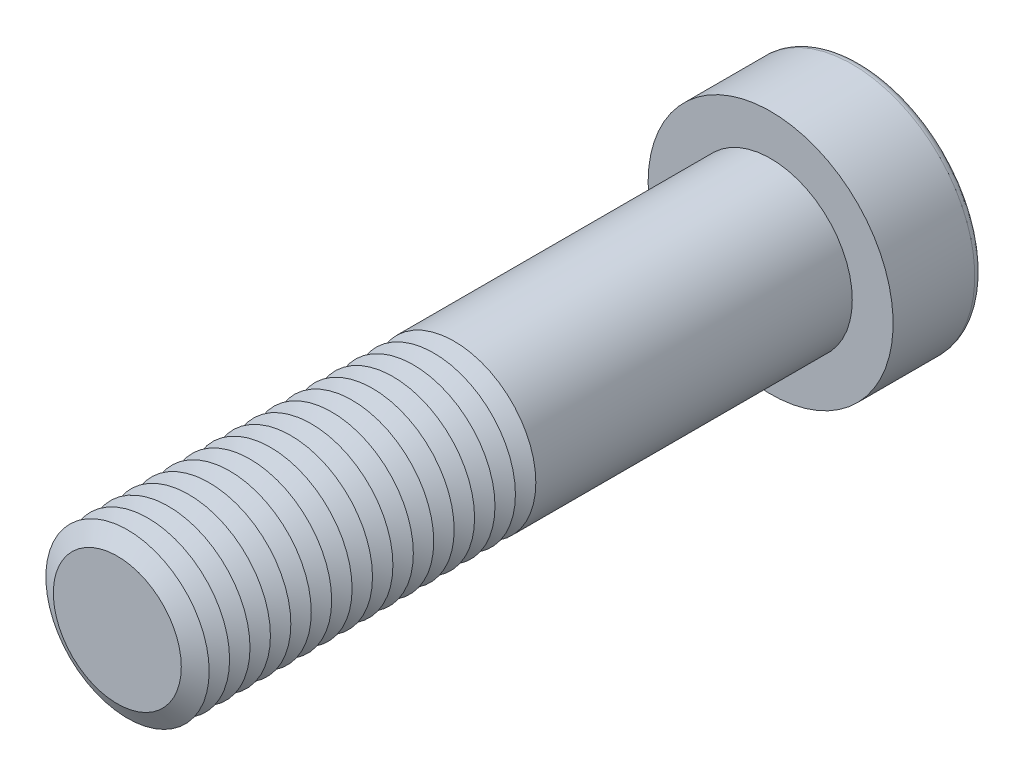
ISO-10303-21;
HEADER;
FILE_DESCRIPTION(('STEP AP214'),'2;1');
FILE_NAME('part.step','',(''),(''),'','','');
FILE_SCHEMA(('AUTOMOTIVE_DESIGN { 1 0 10303 214 1 1 1 1 }'));
ENDSEC;
DATA;
#1=APPLICATION_CONTEXT('core data for automotive mechanical design processes');
#2=APPLICATION_PROTOCOL_DEFINITION('international standard','automotive_design',2000,#1);
#3=PRODUCT_CONTEXT('',#1,'mechanical');
#4=PRODUCT('Part','Part','',(#3));
#5=PRODUCT_RELATED_PRODUCT_CATEGORY('part','',(#4));
#6=PRODUCT_DEFINITION_FORMATION('','',#4);
#7=PRODUCT_DEFINITION_CONTEXT('part definition',#1,'design');
#8=PRODUCT_DEFINITION('design','',#6,#7);
#9=PRODUCT_DEFINITION_SHAPE('','',#8);
#10=(LENGTH_UNIT() NAMED_UNIT(*) SI_UNIT(.MILLI.,.METRE.));
#11=(NAMED_UNIT(*) PLANE_ANGLE_UNIT() SI_UNIT($,.RADIAN.));
#12=(NAMED_UNIT(*) SI_UNIT($,.STERADIAN.) SOLID_ANGLE_UNIT());
#13=UNCERTAINTY_MEASURE_WITH_UNIT(LENGTH_MEASURE(1.E-05),#10,'distance_accuracy_value','');
#14=(GEOMETRIC_REPRESENTATION_CONTEXT(3) GLOBAL_UNCERTAINTY_ASSIGNED_CONTEXT((#13)) GLOBAL_UNIT_ASSIGNED_CONTEXT((#10,
#11,#12)) REPRESENTATION_CONTEXT('',''));
#15=CARTESIAN_POINT('',(0.,0.,0.));
#16=DIRECTION('',(0.,0.,1.));
#17=DIRECTION('',(1.,0.,0.));
#18=AXIS2_PLACEMENT_3D('',#15,#16,#17);
#19=CARTESIAN_POINT('',(0.,0.,71.25));
#20=DIRECTION('',(0.,0.,1.));
#21=DIRECTION('',(1.,0.,0.));
#22=AXIS2_PLACEMENT_3D('',#19,#20,#21);
#23=CONICAL_SURFACE('',#22,10.,1.0471975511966);
#24=CARTESIAN_POINT('',(0.,0.,70.));
#25=DIRECTION('',(0.,0.,1.));
#26=DIRECTION('',(1.,0.,0.));
#27=AXIS2_PLACEMENT_3D('',#24,#25,#26);
#28=CIRCLE('',#27,7.8349364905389);
#29=CARTESIAN_POINT('',(7.8349364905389,0.,70.));
#30=VERTEX_POINT('',#29);
#31=EDGE_CURVE('E313',#30,#30,#28,.T.);
#32=ORIENTED_EDGE('',*,*,#31,.T.);
#33=EDGE_LOOP('',(#32));
#34=FACE_BOUND('',#33,.T.);
#35=CARTESIAN_POINT('',(0.,0.,71.25));
#36=DIRECTION('',(0.,0.,1.));
#37=DIRECTION('',(1.,0.,0.));
#38=AXIS2_PLACEMENT_3D('',#35,#36,#37);
#39=CIRCLE('',#38,10.);
#40=CARTESIAN_POINT('',(10.,0.,71.25));
#41=VERTEX_POINT('',#40);
#42=EDGE_CURVE('E316',#41,#41,#39,.T.);
#43=ORIENTED_EDGE('',*,*,#42,.F.);
#44=EDGE_LOOP('',(#43));
#45=FACE_BOUND('',#44,.T.);
#46=ADVANCED_FACE('F39',(#34,#45),#23,.T.);
#47=CARTESIAN_POINT('',(0.,0.,70.));
#48=DIRECTION('',(0.,0.,-1.));
#49=DIRECTION('',(-1.,0.,0.));
#50=AXIS2_PLACEMENT_3D('',#47,#48,#49);
#51=CONICAL_SURFACE('',#50,7.8349364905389,1.0471975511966);
#52=CARTESIAN_POINT('',(0.,0.,68.75));
#53=DIRECTION('',(0.,0.,1.));
#54=DIRECTION('',(1.,0.,0.));
#55=AXIS2_PLACEMENT_3D('',#52,#53,#54);
#56=CIRCLE('',#55,10.);
#57=CARTESIAN_POINT('',(10.,0.,68.75));
#58=VERTEX_POINT('',#57);
#59=EDGE_CURVE('E324',#58,#58,#56,.T.);
#60=ORIENTED_EDGE('',*,*,#59,.T.);
#61=EDGE_LOOP('',(#60));
#62=FACE_BOUND('',#61,.T.);
#63=ORIENTED_EDGE('',*,*,#31,.F.);
#64=EDGE_LOOP('',(#63));
#65=FACE_BOUND('',#64,.T.);
#66=ADVANCED_FACE('F245',(#62,#65),#51,.T.);
#67=CARTESIAN_POINT('',(0.,0.,80.));
#68=DIRECTION('',(0.,0.,1.));
#69=DIRECTION('',(1.,0.,0.));
#70=AXIS2_PLACEMENT_3D('',#67,#68,#69);
#71=PLANE('',#70);
#72=CARTESIAN_POINT('',(0.,0.,80.));
#73=DIRECTION('',(0.,0.,1.));
#74=DIRECTION('',(1.,0.,0.));
#75=AXIS2_PLACEMENT_3D('',#72,#73,#74);
#76=CIRCLE('',#75,7.8349364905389);
#77=CARTESIAN_POINT('',(7.8349364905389,0.,80.));
#78=VERTEX_POINT('',#77);
#79=EDGE_CURVE('E174',#78,#78,#76,.T.);
#80=ORIENTED_EDGE('',*,*,#79,.T.);
#81=EDGE_LOOP('',(#80));
#82=FACE_BOUND('',#81,.T.);
#83=ADVANCED_FACE('F251',(#82),#71,.T.);
#84=CARTESIAN_POINT('',(0.,0.,80.));
#85=DIRECTION('',(0.,0.,-1.));
#86=DIRECTION('',(-1.,0.,0.));
#87=AXIS2_PLACEMENT_3D('',#84,#85,#86);
#88=CONICAL_SURFACE('',#87,7.8349364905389,1.0471975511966);
#89=CARTESIAN_POINT('',(0.,0.,78.75));
#90=DIRECTION('',(0.,0.,1.));
#91=DIRECTION('',(1.,0.,0.));
#92=AXIS2_PLACEMENT_3D('',#89,#90,#91);
#93=CIRCLE('',#92,10.);
#94=CARTESIAN_POINT('',(10.,0.,78.75));
#95=VERTEX_POINT('',#94);
#96=EDGE_CURVE('E291',#95,#95,#93,.T.);
#97=ORIENTED_EDGE('',*,*,#96,.T.);
#98=EDGE_LOOP('',(#97));
#99=FACE_BOUND('',#98,.T.);
#100=ORIENTED_EDGE('',*,*,#79,.F.);
#101=EDGE_LOOP('',(#100));
#102=FACE_BOUND('',#101,.T.);
#103=ADVANCED_FACE('F199',(#99,#102),#88,.T.);
#104=CARTESIAN_POINT('',(0.,0.,78.75));
#105=DIRECTION('',(0.,0.,1.));
#106=DIRECTION('',(1.,0.,0.));
#107=AXIS2_PLACEMENT_3D('',#104,#105,#106);
#108=CONICAL_SURFACE('',#107,10.,1.0471975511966);
#109=CARTESIAN_POINT('',(0.,0.,77.5));
#110=DIRECTION('',(0.,0.,1.));
#111=DIRECTION('',(1.,0.,0.));
#112=AXIS2_PLACEMENT_3D('',#109,#110,#111);
#113=CIRCLE('',#112,7.8349364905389);
#114=CARTESIAN_POINT('',(7.8349364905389,0.,77.5));
#115=VERTEX_POINT('',#114);
#116=EDGE_CURVE('E288',#115,#115,#113,.T.);
#117=ORIENTED_EDGE('',*,*,#116,.T.);
#118=EDGE_LOOP('',(#117));
#119=FACE_BOUND('',#118,.T.);
#120=ORIENTED_EDGE('',*,*,#96,.F.);
#121=EDGE_LOOP('',(#120));
#122=FACE_BOUND('',#121,.T.);
#123=ADVANCED_FACE('F277',(#119,#122),#108,.T.);
#124=CARTESIAN_POINT('',(0.,0.,77.5));
#125=DIRECTION('',(0.,0.,-1.));
#126=DIRECTION('',(-1.,0.,0.));
#127=AXIS2_PLACEMENT_3D('',#124,#125,#126);
#128=CONICAL_SURFACE('',#127,7.8349364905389,1.0471975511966);
#129=CARTESIAN_POINT('',(0.,0.,76.25));
#130=DIRECTION('',(0.,0.,1.));
#131=DIRECTION('',(1.,0.,0.));
#132=AXIS2_PLACEMENT_3D('',#129,#130,#131);
#133=CIRCLE('',#132,10.);
#134=CARTESIAN_POINT('',(10.,0.,76.25));
#135=VERTEX_POINT('',#134);
#136=EDGE_CURVE('E299',#135,#135,#133,.T.);
#137=ORIENTED_EDGE('',*,*,#136,.T.);
#138=EDGE_LOOP('',(#137));
#139=FACE_BOUND('',#138,.T.);
#140=ORIENTED_EDGE('',*,*,#116,.F.);
#141=EDGE_LOOP('',(#140));
#142=FACE_BOUND('',#141,.T.);
#143=ADVANCED_FACE('F274',(#139,#142),#128,.T.);
#144=CARTESIAN_POINT('',(0.,0.,76.25));
#145=DIRECTION('',(0.,0.,1.));
#146=DIRECTION('',(1.,0.,0.));
#147=AXIS2_PLACEMENT_3D('',#144,#145,#146);
#148=CONICAL_SURFACE('',#147,10.,1.0471975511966);
#149=CARTESIAN_POINT('',(0.,0.,75.));
#150=DIRECTION('',(0.,0.,1.));
#151=DIRECTION('',(1.,0.,0.));
#152=AXIS2_PLACEMENT_3D('',#149,#150,#151);
#153=CIRCLE('',#152,7.8349364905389);
#154=CARTESIAN_POINT('',(7.8349364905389,0.,75.));
#155=VERTEX_POINT('',#154);
#156=EDGE_CURVE('E293',#155,#155,#153,.T.);
#157=ORIENTED_EDGE('',*,*,#156,.T.);
#158=EDGE_LOOP('',(#157));
#159=FACE_BOUND('',#158,.T.);
#160=ORIENTED_EDGE('',*,*,#136,.F.);
#161=EDGE_LOOP('',(#160));
#162=FACE_BOUND('',#161,.T.);
#163=ADVANCED_FACE('F270',(#159,#162),#148,.T.);
#164=CARTESIAN_POINT('',(0.,0.,75.));
#165=DIRECTION('',(0.,0.,-1.));
#166=DIRECTION('',(-1.,0.,0.));
#167=AXIS2_PLACEMENT_3D('',#164,#165,#166);
#168=CONICAL_SURFACE('',#167,7.8349364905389,1.0471975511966);
#169=CARTESIAN_POINT('',(0.,0.,73.75));
#170=DIRECTION('',(0.,0.,1.));
#171=DIRECTION('',(1.,0.,0.));
#172=AXIS2_PLACEMENT_3D('',#169,#170,#171);
#173=CIRCLE('',#172,10.);
#174=CARTESIAN_POINT('',(10.,0.,73.75));
#175=VERTEX_POINT('',#174);
#176=EDGE_CURVE('E309',#175,#175,#173,.T.);
#177=ORIENTED_EDGE('',*,*,#176,.T.);
#178=EDGE_LOOP('',(#177));
#179=FACE_BOUND('',#178,.T.);
#180=ORIENTED_EDGE('',*,*,#156,.F.);
#181=EDGE_LOOP('',(#180));
#182=FACE_BOUND('',#181,.T.);
#183=ADVANCED_FACE('F266',(#179,#182),#168,.T.);
#184=CARTESIAN_POINT('',(0.,0.,73.75));
#185=DIRECTION('',(0.,0.,1.));
#186=DIRECTION('',(1.,0.,0.));
#187=AXIS2_PLACEMENT_3D('',#184,#185,#186);
#188=CONICAL_SURFACE('',#187,10.,1.0471975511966);
#189=CARTESIAN_POINT('',(0.,0.,72.5));
#190=DIRECTION('',(0.,0.,1.));
#191=DIRECTION('',(1.,0.,0.));
#192=AXIS2_PLACEMENT_3D('',#189,#190,#191);
#193=CIRCLE('',#192,7.8349364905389);
#194=CARTESIAN_POINT('',(7.8349364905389,0.,72.5));
#195=VERTEX_POINT('',#194);
#196=EDGE_CURVE('E305',#195,#195,#193,.T.);
#197=ORIENTED_EDGE('',*,*,#196,.T.);
#198=EDGE_LOOP('',(#197));
#199=FACE_BOUND('',#198,.T.);
#200=ORIENTED_EDGE('',*,*,#176,.F.);
#201=EDGE_LOOP('',(#200));
#202=FACE_BOUND('',#201,.T.);
#203=ADVANCED_FACE('F262',(#199,#202),#188,.T.);
#204=CARTESIAN_POINT('',(0.,0.,72.5));
#205=DIRECTION('',(0.,0.,-1.));
#206=DIRECTION('',(-1.,0.,0.));
#207=AXIS2_PLACEMENT_3D('',#204,#205,#206);
#208=CONICAL_SURFACE('',#207,7.8349364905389,1.0471975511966);
#209=ORIENTED_EDGE('',*,*,#42,.T.);
#210=EDGE_LOOP('',(#209));
#211=FACE_BOUND('',#210,.T.);
#212=ORIENTED_EDGE('',*,*,#196,.F.);
#213=EDGE_LOOP('',(#212));
#214=FACE_BOUND('',#213,.T.);
#215=ADVANCED_FACE('F258',(#211,#214),#208,.T.);
#216=CARTESIAN_POINT('',(0.,0.,68.75));
#217=DIRECTION('',(0.,0.,1.));
#218=DIRECTION('',(1.,0.,0.));
#219=AXIS2_PLACEMENT_3D('',#216,#217,#218);
#220=CONICAL_SURFACE('',#219,10.,1.0471975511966);
#221=CARTESIAN_POINT('',(0.,0.,67.5));
#222=DIRECTION('',(0.,0.,1.));
#223=DIRECTION('',(1.,0.,0.));
#224=AXIS2_PLACEMENT_3D('',#221,#222,#223);
#225=CIRCLE('',#224,7.8349364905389);
#226=CARTESIAN_POINT('',(7.8349364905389,0.,67.5));
#227=VERTEX_POINT('',#226);
#228=EDGE_CURVE('E320',#227,#227,#225,.T.);
#229=ORIENTED_EDGE('',*,*,#228,.T.);
#230=EDGE_LOOP('',(#229));
#231=FACE_BOUND('',#230,.T.);
#232=ORIENTED_EDGE('',*,*,#59,.F.);
#233=EDGE_LOOP('',(#232));
#234=FACE_BOUND('',#233,.T.);
#235=ADVANCED_FACE('F261',(#231,#234),#220,.T.);
#236=CARTESIAN_POINT('',(0.,0.,67.5));
#237=DIRECTION('',(0.,0.,-1.));
#238=DIRECTION('',(-1.,0.,0.));
#239=AXIS2_PLACEMENT_3D('',#236,#237,#238);
#240=CONICAL_SURFACE('',#239,7.8349364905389,1.0471975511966);
#241=CARTESIAN_POINT('',(0.,0.,66.25));
#242=DIRECTION('',(0.,0.,1.));
#243=DIRECTION('',(1.,0.,0.));
#244=AXIS2_PLACEMENT_3D('',#241,#242,#243);
#245=CIRCLE('',#244,10.);
#246=CARTESIAN_POINT('',(10.,0.,66.25));
#247=VERTEX_POINT('',#246);
#248=EDGE_CURVE('E331',#247,#247,#245,.T.);
#249=ORIENTED_EDGE('',*,*,#248,.T.);
#250=EDGE_LOOP('',(#249));
#251=FACE_BOUND('',#250,.T.);
#252=ORIENTED_EDGE('',*,*,#228,.F.);
#253=EDGE_LOOP('',(#252));
#254=FACE_BOUND('',#253,.T.);
#255=ADVANCED_FACE('F511',(#251,#254),#240,.T.);
#256=CARTESIAN_POINT('',(0.,0.,66.25));
#257=DIRECTION('',(0.,0.,1.));
#258=DIRECTION('',(1.,0.,0.));
#259=AXIS2_PLACEMENT_3D('',#256,#257,#258);
#260=CONICAL_SURFACE('',#259,10.,1.0471975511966);
#261=CARTESIAN_POINT('',(0.,0.,65.));
#262=DIRECTION('',(0.,0.,1.));
#263=DIRECTION('',(1.,0.,0.));
#264=AXIS2_PLACEMENT_3D('',#261,#262,#263);
#265=CIRCLE('',#264,7.8349364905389);
#266=CARTESIAN_POINT('',(7.8349364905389,0.,65.));
#267=VERTEX_POINT('',#266);
#268=EDGE_CURVE('E327',#267,#267,#265,.T.);
#269=ORIENTED_EDGE('',*,*,#268,.T.);
#270=EDGE_LOOP('',(#269));
#271=FACE_BOUND('',#270,.T.);
#272=ORIENTED_EDGE('',*,*,#248,.F.);
#273=EDGE_LOOP('',(#272));
#274=FACE_BOUND('',#273,.T.);
#275=ADVANCED_FACE('F507',(#271,#274),#260,.T.);
#276=CARTESIAN_POINT('',(0.,0.,65.));
#277=DIRECTION('',(0.,0.,-1.));
#278=DIRECTION('',(-1.,0.,0.));
#279=AXIS2_PLACEMENT_3D('',#276,#277,#278);
#280=CONICAL_SURFACE('',#279,7.8349364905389,1.0471975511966);
#281=CARTESIAN_POINT('',(0.,0.,63.75));
#282=DIRECTION('',(0.,0.,1.));
#283=DIRECTION('',(1.,0.,0.));
#284=AXIS2_PLACEMENT_3D('',#281,#282,#283);
#285=CIRCLE('',#284,10.);
#286=CARTESIAN_POINT('',(10.,0.,63.75));
#287=VERTEX_POINT('',#286);
#288=EDGE_CURVE('E339',#287,#287,#285,.T.);
#289=ORIENTED_EDGE('',*,*,#288,.T.);
#290=EDGE_LOOP('',(#289));
#291=FACE_BOUND('',#290,.T.);
#292=ORIENTED_EDGE('',*,*,#268,.F.);
#293=EDGE_LOOP('',(#292));
#294=FACE_BOUND('',#293,.T.);
#295=ADVANCED_FACE('F503',(#291,#294),#280,.T.);
#296=CARTESIAN_POINT('',(0.,0.,63.75));
#297=DIRECTION('',(0.,0.,1.));
#298=DIRECTION('',(1.,0.,0.));
#299=AXIS2_PLACEMENT_3D('',#296,#297,#298);
#300=CONICAL_SURFACE('',#299,10.,1.0471975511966);
#301=CARTESIAN_POINT('',(0.,0.,62.5));
#302=DIRECTION('',(0.,0.,1.));
#303=DIRECTION('',(1.,0.,0.));
#304=AXIS2_PLACEMENT_3D('',#301,#302,#303);
#305=CIRCLE('',#304,7.8349364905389);
#306=CARTESIAN_POINT('',(7.8349364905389,0.,62.5));
#307=VERTEX_POINT('',#306);
#308=EDGE_CURVE('E335',#307,#307,#305,.T.);
#309=ORIENTED_EDGE('',*,*,#308,.T.);
#310=EDGE_LOOP('',(#309));
#311=FACE_BOUND('',#310,.T.);
#312=ORIENTED_EDGE('',*,*,#288,.F.);
#313=EDGE_LOOP('',(#312));
#314=FACE_BOUND('',#313,.T.);
#315=ADVANCED_FACE('F499',(#311,#314),#300,.T.);
#316=CARTESIAN_POINT('',(0.,0.,62.5));
#317=DIRECTION('',(0.,0.,-1.));
#318=DIRECTION('',(-1.,0.,0.));
#319=AXIS2_PLACEMENT_3D('',#316,#317,#318);
#320=CONICAL_SURFACE('',#319,7.8349364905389,1.0471975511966);
#321=CARTESIAN_POINT('',(0.,0.,61.25));
#322=DIRECTION('',(0.,0.,1.));
#323=DIRECTION('',(1.,0.,0.));
#324=AXIS2_PLACEMENT_3D('',#321,#322,#323);
#325=CIRCLE('',#324,10.);
#326=CARTESIAN_POINT('',(10.,0.,61.25));
#327=VERTEX_POINT('',#326);
#328=EDGE_CURVE('E347',#327,#327,#325,.T.);
#329=ORIENTED_EDGE('',*,*,#328,.T.);
#330=EDGE_LOOP('',(#329));
#331=FACE_BOUND('',#330,.T.);
#332=ORIENTED_EDGE('',*,*,#308,.F.);
#333=EDGE_LOOP('',(#332));
#334=FACE_BOUND('',#333,.T.);
#335=ADVANCED_FACE('F495',(#331,#334),#320,.T.);
#336=CARTESIAN_POINT('',(0.,0.,61.25));
#337=DIRECTION('',(0.,0.,1.));
#338=DIRECTION('',(1.,0.,0.));
#339=AXIS2_PLACEMENT_3D('',#336,#337,#338);
#340=CONICAL_SURFACE('',#339,10.,1.0471975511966);
#341=CARTESIAN_POINT('',(0.,0.,60.));
#342=DIRECTION('',(0.,0.,1.));
#343=DIRECTION('',(1.,0.,0.));
#344=AXIS2_PLACEMENT_3D('',#341,#342,#343);
#345=CIRCLE('',#344,7.8349364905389);
#346=CARTESIAN_POINT('',(7.8349364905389,0.,60.));
#347=VERTEX_POINT('',#346);
#348=EDGE_CURVE('E343',#347,#347,#345,.T.);
#349=ORIENTED_EDGE('',*,*,#348,.T.);
#350=EDGE_LOOP('',(#349));
#351=FACE_BOUND('',#350,.T.);
#352=ORIENTED_EDGE('',*,*,#328,.F.);
#353=EDGE_LOOP('',(#352));
#354=FACE_BOUND('',#353,.T.);
#355=ADVANCED_FACE('F491',(#351,#354),#340,.T.);
#356=CARTESIAN_POINT('',(0.,0.,60.));
#357=DIRECTION('',(0.,0.,-1.));
#358=DIRECTION('',(-1.,0.,0.));
#359=AXIS2_PLACEMENT_3D('',#356,#357,#358);
#360=CONICAL_SURFACE('',#359,7.8349364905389,1.0471975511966);
#361=CARTESIAN_POINT('',(0.,0.,58.75));
#362=DIRECTION('',(0.,0.,1.));
#363=DIRECTION('',(1.,0.,0.));
#364=AXIS2_PLACEMENT_3D('',#361,#362,#363);
#365=CIRCLE('',#364,10.);
#366=CARTESIAN_POINT('',(10.,0.,58.75));
#367=VERTEX_POINT('',#366);
#368=EDGE_CURVE('E355',#367,#367,#365,.T.);
#369=ORIENTED_EDGE('',*,*,#368,.T.);
#370=EDGE_LOOP('',(#369));
#371=FACE_BOUND('',#370,.T.);
#372=ORIENTED_EDGE('',*,*,#348,.F.);
#373=EDGE_LOOP('',(#372));
#374=FACE_BOUND('',#373,.T.);
#375=ADVANCED_FACE('F487',(#371,#374),#360,.T.);
#376=CARTESIAN_POINT('',(0.,0.,58.75));
#377=DIRECTION('',(0.,0.,1.));
#378=DIRECTION('',(1.,0.,0.));
#379=AXIS2_PLACEMENT_3D('',#376,#377,#378);
#380=CONICAL_SURFACE('',#379,10.,1.0471975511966);
#381=CARTESIAN_POINT('',(0.,0.,57.5));
#382=DIRECTION('',(0.,0.,1.));
#383=DIRECTION('',(1.,0.,0.));
#384=AXIS2_PLACEMENT_3D('',#381,#382,#383);
#385=CIRCLE('',#384,7.8349364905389);
#386=CARTESIAN_POINT('',(7.8349364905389,0.,57.5));
#387=VERTEX_POINT('',#386);
#388=EDGE_CURVE('E351',#387,#387,#385,.T.);
#389=ORIENTED_EDGE('',*,*,#388,.T.);
#390=EDGE_LOOP('',(#389));
#391=FACE_BOUND('',#390,.T.);
#392=ORIENTED_EDGE('',*,*,#368,.F.);
#393=EDGE_LOOP('',(#392));
#394=FACE_BOUND('',#393,.T.);
#395=ADVANCED_FACE('F483',(#391,#394),#380,.T.);
#396=CARTESIAN_POINT('',(0.,0.,57.5));
#397=DIRECTION('',(0.,0.,-1.));
#398=DIRECTION('',(-1.,0.,0.));
#399=AXIS2_PLACEMENT_3D('',#396,#397,#398);
#400=CONICAL_SURFACE('',#399,7.8349364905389,1.0471975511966);
#401=CARTESIAN_POINT('',(0.,0.,56.25));
#402=DIRECTION('',(0.,0.,1.));
#403=DIRECTION('',(1.,0.,0.));
#404=AXIS2_PLACEMENT_3D('',#401,#402,#403);
#405=CIRCLE('',#404,10.);
#406=CARTESIAN_POINT('',(10.,0.,56.25));
#407=VERTEX_POINT('',#406);
#408=EDGE_CURVE('E363',#407,#407,#405,.T.);
#409=ORIENTED_EDGE('',*,*,#408,.T.);
#410=EDGE_LOOP('',(#409));
#411=FACE_BOUND('',#410,.T.);
#412=ORIENTED_EDGE('',*,*,#388,.F.);
#413=EDGE_LOOP('',(#412));
#414=FACE_BOUND('',#413,.T.);
#415=ADVANCED_FACE('F479',(#411,#414),#400,.T.);
#416=CARTESIAN_POINT('',(0.,0.,56.25));
#417=DIRECTION('',(0.,0.,1.));
#418=DIRECTION('',(1.,0.,0.));
#419=AXIS2_PLACEMENT_3D('',#416,#417,#418);
#420=CONICAL_SURFACE('',#419,10.,1.0471975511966);
#421=CARTESIAN_POINT('',(0.,0.,55.));
#422=DIRECTION('',(0.,0.,1.));
#423=DIRECTION('',(1.,0.,0.));
#424=AXIS2_PLACEMENT_3D('',#421,#422,#423);
#425=CIRCLE('',#424,7.8349364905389);
#426=CARTESIAN_POINT('',(7.8349364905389,0.,55.));
#427=VERTEX_POINT('',#426);
#428=EDGE_CURVE('E359',#427,#427,#425,.T.);
#429=ORIENTED_EDGE('',*,*,#428,.T.);
#430=EDGE_LOOP('',(#429));
#431=FACE_BOUND('',#430,.T.);
#432=ORIENTED_EDGE('',*,*,#408,.F.);
#433=EDGE_LOOP('',(#432));
#434=FACE_BOUND('',#433,.T.);
#435=ADVANCED_FACE('F475',(#431,#434),#420,.T.);
#436=CARTESIAN_POINT('',(0.,0.,55.));
#437=DIRECTION('',(0.,0.,-1.));
#438=DIRECTION('',(-1.,0.,0.));
#439=AXIS2_PLACEMENT_3D('',#436,#437,#438);
#440=CONICAL_SURFACE('',#439,7.8349364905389,1.0471975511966);
#441=CARTESIAN_POINT('',(0.,0.,53.75));
#442=DIRECTION('',(0.,0.,1.));
#443=DIRECTION('',(1.,0.,0.));
#444=AXIS2_PLACEMENT_3D('',#441,#442,#443);
#445=CIRCLE('',#444,10.);
#446=CARTESIAN_POINT('',(10.,0.,53.75));
#447=VERTEX_POINT('',#446);
#448=EDGE_CURVE('E371',#447,#447,#445,.T.);
#449=ORIENTED_EDGE('',*,*,#448,.T.);
#450=EDGE_LOOP('',(#449));
#451=FACE_BOUND('',#450,.T.);
#452=ORIENTED_EDGE('',*,*,#428,.F.);
#453=EDGE_LOOP('',(#452));
#454=FACE_BOUND('',#453,.T.);
#455=ADVANCED_FACE('F471',(#451,#454),#440,.T.);
#456=CARTESIAN_POINT('',(0.,0.,53.75));
#457=DIRECTION('',(0.,0.,1.));
#458=DIRECTION('',(1.,0.,0.));
#459=AXIS2_PLACEMENT_3D('',#456,#457,#458);
#460=CONICAL_SURFACE('',#459,10.,1.0471975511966);
#461=CARTESIAN_POINT('',(0.,0.,52.5));
#462=DIRECTION('',(0.,0.,1.));
#463=DIRECTION('',(1.,0.,0.));
#464=AXIS2_PLACEMENT_3D('',#461,#462,#463);
#465=CIRCLE('',#464,7.8349364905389);
#466=CARTESIAN_POINT('',(7.8349364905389,0.,52.5));
#467=VERTEX_POINT('',#466);
#468=EDGE_CURVE('E367',#467,#467,#465,.T.);
#469=ORIENTED_EDGE('',*,*,#468,.T.);
#470=EDGE_LOOP('',(#469));
#471=FACE_BOUND('',#470,.T.);
#472=ORIENTED_EDGE('',*,*,#448,.F.);
#473=EDGE_LOOP('',(#472));
#474=FACE_BOUND('',#473,.T.);
#475=ADVANCED_FACE('F467',(#471,#474),#460,.T.);
#476=CARTESIAN_POINT('',(0.,0.,52.5));
#477=DIRECTION('',(0.,0.,-1.));
#478=DIRECTION('',(-1.,0.,0.));
#479=AXIS2_PLACEMENT_3D('',#476,#477,#478);
#480=CONICAL_SURFACE('',#479,7.8349364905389,1.0471975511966);
#481=CARTESIAN_POINT('',(0.,0.,51.25));
#482=DIRECTION('',(0.,0.,1.));
#483=DIRECTION('',(1.,0.,0.));
#484=AXIS2_PLACEMENT_3D('',#481,#482,#483);
#485=CIRCLE('',#484,10.);
#486=CARTESIAN_POINT('',(10.,0.,51.25));
#487=VERTEX_POINT('',#486);
#488=EDGE_CURVE('E379',#487,#487,#485,.T.);
#489=ORIENTED_EDGE('',*,*,#488,.T.);
#490=EDGE_LOOP('',(#489));
#491=FACE_BOUND('',#490,.T.);
#492=ORIENTED_EDGE('',*,*,#468,.F.);
#493=EDGE_LOOP('',(#492));
#494=FACE_BOUND('',#493,.T.);
#495=ADVANCED_FACE('F463',(#491,#494),#480,.T.);
#496=CARTESIAN_POINT('',(0.,0.,51.25));
#497=DIRECTION('',(0.,0.,1.));
#498=DIRECTION('',(1.,0.,0.));
#499=AXIS2_PLACEMENT_3D('',#496,#497,#498);
#500=CONICAL_SURFACE('',#499,10.,1.0471975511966);
#501=CARTESIAN_POINT('',(0.,0.,50.));
#502=DIRECTION('',(0.,0.,1.));
#503=DIRECTION('',(1.,0.,0.));
#504=AXIS2_PLACEMENT_3D('',#501,#502,#503);
#505=CIRCLE('',#504,7.8349364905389);
#506=CARTESIAN_POINT('',(7.8349364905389,0.,50.));
#507=VERTEX_POINT('',#506);
#508=EDGE_CURVE('E375',#507,#507,#505,.T.);
#509=ORIENTED_EDGE('',*,*,#508,.T.);
#510=EDGE_LOOP('',(#509));
#511=FACE_BOUND('',#510,.T.);
#512=ORIENTED_EDGE('',*,*,#488,.F.);
#513=EDGE_LOOP('',(#512));
#514=FACE_BOUND('',#513,.T.);
#515=ADVANCED_FACE('F459',(#511,#514),#500,.T.);
#516=CARTESIAN_POINT('',(0.,0.,50.));
#517=DIRECTION('',(0.,0.,-1.));
#518=DIRECTION('',(-1.,0.,0.));
#519=AXIS2_PLACEMENT_3D('',#516,#517,#518);
#520=CONICAL_SURFACE('',#519,7.8349364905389,1.0471975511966);
#521=CARTESIAN_POINT('',(0.,0.,48.75));
#522=DIRECTION('',(0.,0.,1.));
#523=DIRECTION('',(1.,0.,0.));
#524=AXIS2_PLACEMENT_3D('',#521,#522,#523);
#525=CIRCLE('',#524,10.);
#526=CARTESIAN_POINT('',(10.,0.,48.75));
#527=VERTEX_POINT('',#526);
#528=EDGE_CURVE('E386',#527,#527,#525,.T.);
#529=ORIENTED_EDGE('',*,*,#528,.T.);
#530=EDGE_LOOP('',(#529));
#531=FACE_BOUND('',#530,.T.);
#532=ORIENTED_EDGE('',*,*,#508,.F.);
#533=EDGE_LOOP('',(#532));
#534=FACE_BOUND('',#533,.T.);
#535=ADVANCED_FACE('F455',(#531,#534),#520,.T.);
#536=CARTESIAN_POINT('',(0.,0.,48.75));
#537=DIRECTION('',(0.,0.,1.));
#538=DIRECTION('',(1.,0.,0.));
#539=AXIS2_PLACEMENT_3D('',#536,#537,#538);
#540=CONICAL_SURFACE('',#539,10.,1.0471975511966);
#541=CARTESIAN_POINT('',(0.,0.,47.5));
#542=DIRECTION('',(0.,0.,1.));
#543=DIRECTION('',(1.,0.,0.));
#544=AXIS2_PLACEMENT_3D('',#541,#542,#543);
#545=CIRCLE('',#544,7.8349364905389);
#546=CARTESIAN_POINT('',(7.8349364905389,0.,47.5));
#547=VERTEX_POINT('',#546);
#548=EDGE_CURVE('E382',#547,#547,#545,.T.);
#549=ORIENTED_EDGE('',*,*,#548,.T.);
#550=EDGE_LOOP('',(#549));
#551=FACE_BOUND('',#550,.T.);
#552=ORIENTED_EDGE('',*,*,#528,.F.);
#553=EDGE_LOOP('',(#552));
#554=FACE_BOUND('',#553,.T.);
#555=ADVANCED_FACE('F451',(#551,#554),#540,.T.);
#556=CARTESIAN_POINT('',(0.,0.,47.5));
#557=DIRECTION('',(0.,0.,-1.));
#558=DIRECTION('',(-1.,0.,0.));
#559=AXIS2_PLACEMENT_3D('',#556,#557,#558);
#560=CONICAL_SURFACE('',#559,7.8349364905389,1.0471975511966);
#561=CARTESIAN_POINT('',(0.,0.,46.25));
#562=DIRECTION('',(0.,0.,1.));
#563=DIRECTION('',(1.,0.,0.));
#564=AXIS2_PLACEMENT_3D('',#561,#562,#563);
#565=CIRCLE('',#564,10.);
#566=CARTESIAN_POINT('',(10.,0.,46.25));
#567=VERTEX_POINT('',#566);
#568=EDGE_CURVE('E394',#567,#567,#565,.T.);
#569=ORIENTED_EDGE('',*,*,#568,.T.);
#570=EDGE_LOOP('',(#569));
#571=FACE_BOUND('',#570,.T.);
#572=ORIENTED_EDGE('',*,*,#548,.F.);
#573=EDGE_LOOP('',(#572));
#574=FACE_BOUND('',#573,.T.);
#575=ADVANCED_FACE('F447',(#571,#574),#560,.T.);
#576=CARTESIAN_POINT('',(0.,0.,46.25));
#577=DIRECTION('',(0.,0.,1.));
#578=DIRECTION('',(1.,0.,0.));
#579=AXIS2_PLACEMENT_3D('',#576,#577,#578);
#580=CONICAL_SURFACE('',#579,10.,1.0471975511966);
#581=CARTESIAN_POINT('',(0.,0.,45.));
#582=DIRECTION('',(0.,0.,1.));
#583=DIRECTION('',(1.,0.,0.));
#584=AXIS2_PLACEMENT_3D('',#581,#582,#583);
#585=CIRCLE('',#584,7.8349364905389);
#586=CARTESIAN_POINT('',(7.8349364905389,0.,45.));
#587=VERTEX_POINT('',#586);
#588=EDGE_CURVE('E390',#587,#587,#585,.T.);
#589=ORIENTED_EDGE('',*,*,#588,.T.);
#590=EDGE_LOOP('',(#589));
#591=FACE_BOUND('',#590,.T.);
#592=ORIENTED_EDGE('',*,*,#568,.F.);
#593=EDGE_LOOP('',(#592));
#594=FACE_BOUND('',#593,.T.);
#595=ADVANCED_FACE('F443',(#591,#594),#580,.T.);
#596=CARTESIAN_POINT('',(0.,0.,45.));
#597=DIRECTION('',(0.,0.,-1.));
#598=DIRECTION('',(-1.,0.,0.));
#599=AXIS2_PLACEMENT_3D('',#596,#597,#598);
#600=CONICAL_SURFACE('',#599,7.8349364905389,1.0471975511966);
#601=CARTESIAN_POINT('',(0.,0.,43.75));
#602=DIRECTION('',(0.,0.,1.));
#603=DIRECTION('',(1.,0.,0.));
#604=AXIS2_PLACEMENT_3D('',#601,#602,#603);
#605=CIRCLE('',#604,10.);
#606=CARTESIAN_POINT('',(10.,0.,43.75));
#607=VERTEX_POINT('',#606);
#608=EDGE_CURVE('E402',#607,#607,#605,.T.);
#609=ORIENTED_EDGE('',*,*,#608,.T.);
#610=EDGE_LOOP('',(#609));
#611=FACE_BOUND('',#610,.T.);
#612=ORIENTED_EDGE('',*,*,#588,.F.);
#613=EDGE_LOOP('',(#612));
#614=FACE_BOUND('',#613,.T.);
#615=ADVANCED_FACE('F439',(#611,#614),#600,.T.);
#616=CARTESIAN_POINT('',(0.,0.,43.75));
#617=DIRECTION('',(0.,0.,1.));
#618=DIRECTION('',(1.,0.,0.));
#619=AXIS2_PLACEMENT_3D('',#616,#617,#618);
#620=CONICAL_SURFACE('',#619,10.,1.0471975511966);
#621=CARTESIAN_POINT('',(0.,0.,42.5));
#622=DIRECTION('',(0.,0.,1.));
#623=DIRECTION('',(1.,0.,0.));
#624=AXIS2_PLACEMENT_3D('',#621,#622,#623);
#625=CIRCLE('',#624,7.8349364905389);
#626=CARTESIAN_POINT('',(7.8349364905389,0.,42.5));
#627=VERTEX_POINT('',#626);
#628=EDGE_CURVE('E398',#627,#627,#625,.T.);
#629=ORIENTED_EDGE('',*,*,#628,.T.);
#630=EDGE_LOOP('',(#629));
#631=FACE_BOUND('',#630,.T.);
#632=ORIENTED_EDGE('',*,*,#608,.F.);
#633=EDGE_LOOP('',(#632));
#634=FACE_BOUND('',#633,.T.);
#635=ADVANCED_FACE('F434',(#631,#634),#620,.T.);
#636=CARTESIAN_POINT('',(0.,0.,42.5));
#637=DIRECTION('',(0.,0.,-1.));
#638=DIRECTION('',(-1.,0.,0.));
#639=AXIS2_PLACEMENT_3D('',#636,#637,#638);
#640=CONICAL_SURFACE('',#639,7.8349364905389,1.0471975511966);
#641=CARTESIAN_POINT('',(0.,0.,41.25));
#642=DIRECTION('',(0.,0.,1.));
#643=DIRECTION('',(1.,0.,0.));
#644=AXIS2_PLACEMENT_3D('',#641,#642,#643);
#645=CIRCLE('',#644,10.);
#646=CARTESIAN_POINT('',(10.,0.,41.25));
#647=VERTEX_POINT('',#646);
#648=EDGE_CURVE('E414',#647,#647,#645,.T.);
#649=ORIENTED_EDGE('',*,*,#648,.T.);
#650=EDGE_LOOP('',(#649));
#651=FACE_BOUND('',#650,.T.);
#652=ORIENTED_EDGE('',*,*,#628,.F.);
#653=EDGE_LOOP('',(#652));
#654=FACE_BOUND('',#653,.T.);
#655=ADVANCED_FACE('F420',(#651,#654),#640,.T.);
#656=CARTESIAN_POINT('',(0.,0.,41.25));
#657=DIRECTION('',(0.,0.,1.));
#658=DIRECTION('',(1.,0.,0.));
#659=AXIS2_PLACEMENT_3D('',#656,#657,#658);
#660=CONICAL_SURFACE('',#659,10.,1.0471975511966);
#661=CARTESIAN_POINT('',(0.,0.,40.));
#662=DIRECTION('',(0.,0.,1.));
#663=DIRECTION('',(1.,0.,0.));
#664=AXIS2_PLACEMENT_3D('',#661,#662,#663);
#665=CIRCLE('',#664,7.8349364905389);
#666=CARTESIAN_POINT('',(7.8349364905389,0.,40.));
#667=VERTEX_POINT('',#666);
#668=EDGE_CURVE('E406',#667,#667,#665,.T.);
#669=ORIENTED_EDGE('',*,*,#668,.T.);
#670=EDGE_LOOP('',(#669));
#671=FACE_BOUND('',#670,.T.);
#672=ORIENTED_EDGE('',*,*,#648,.F.);
#673=EDGE_LOOP('',(#672));
#674=FACE_BOUND('',#673,.T.);
#675=ADVANCED_FACE('F423',(#671,#674),#660,.T.);
#676=CARTESIAN_POINT('',(0.,0.,40.));
#677=DIRECTION('',(0.,0.,-1.));
#678=DIRECTION('',(-1.,0.,0.));
#679=AXIS2_PLACEMENT_3D('',#676,#677,#678);
#680=CONICAL_SURFACE('',#679,7.8349364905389,1.0471975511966);
#681=CARTESIAN_POINT('',(0.,0.,38.75));
#682=DIRECTION('',(0.,0.,1.));
#683=DIRECTION('',(1.,0.,0.));
#684=AXIS2_PLACEMENT_3D('',#681,#682,#683);
#685=CIRCLE('',#684,10.);
#686=CARTESIAN_POINT('',(10.,0.,38.75));
#687=VERTEX_POINT('',#686);
#688=EDGE_CURVE('E410',#687,#687,#685,.T.);
#689=ORIENTED_EDGE('',*,*,#688,.T.);
#690=EDGE_LOOP('',(#689));
#691=FACE_BOUND('',#690,.T.);
#692=ORIENTED_EDGE('',*,*,#668,.F.);
#693=EDGE_LOOP('',(#692));
#694=FACE_BOUND('',#693,.T.);
#695=ADVANCED_FACE('F425',(#691,#694),#680,.T.);
#696=CARTESIAN_POINT('',(0.,0.,-0.499999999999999));
#697=DIRECTION('',(0.,0.,-1.));
#698=DIRECTION('',(-1.,0.,0.));
#699=AXIS2_PLACEMENT_3D('',#696,#697,#698);
#700=CONICAL_SURFACE('',#699,7.,1.0471975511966);
#701=CARTESIAN_POINT('',(0.,0.,3.54145188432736));
#702=VERTEX_POINT('',#701);
#703=VERTEX_LOOP('',#702);
#704=FACE_BOUND('',#703,.T.);
#705=CARTESIAN_POINT('',(0.,0.,-0.499999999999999));
#706=DIRECTION('',(0.,0.,-1.));
#707=DIRECTION('',(-1.,0.,0.));
#708=AXIS2_PLACEMENT_3D('',#705,#706,#707);
#709=CIRCLE('',#708,7.);
#710=CARTESIAN_POINT('',(-6.06217782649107,3.5,-0.499999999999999));
#711=VERTEX_POINT('',#710);
#712=CARTESIAN_POINT('',(0.,7.,-0.499999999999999));
#713=VERTEX_POINT('',#712);
#714=EDGE_CURVE('E149',#711,#713,#709,.T.);
#715=ORIENTED_EDGE('',*,*,#714,.T.);
#716=CARTESIAN_POINT('',(0.,0.,-0.499999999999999));
#717=DIRECTION('',(0.,0.,-1.));
#718=DIRECTION('',(-1.,0.,0.));
#719=AXIS2_PLACEMENT_3D('',#716,#717,#718);
#720=CIRCLE('',#719,7.);
#721=CARTESIAN_POINT('',(6.06217782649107,3.5,-0.499999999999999));
#722=VERTEX_POINT('',#721);
#723=EDGE_CURVE('E54',#713,#722,#720,.T.);
#724=ORIENTED_EDGE('',*,*,#723,.T.);
#725=CARTESIAN_POINT('',(6.06217782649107,-3.5,-0.499999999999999));
#726=VERTEX_POINT('',#725);
#727=EDGE_CURVE('E1028',#722,#726,#720,.T.);
#728=ORIENTED_EDGE('',*,*,#727,.T.);
#729=CARTESIAN_POINT('',(0.,-7.,-0.499999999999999));
#730=VERTEX_POINT('',#729);
#731=EDGE_CURVE('E1026',#726,#730,#720,.T.);
#732=ORIENTED_EDGE('',*,*,#731,.T.);
#733=CARTESIAN_POINT('',(-6.06217782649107,-3.5,-0.499999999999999));
#734=VERTEX_POINT('',#733);
#735=EDGE_CURVE('E1020',#730,#734,#720,.T.);
#736=ORIENTED_EDGE('',*,*,#735,.T.);
#737=EDGE_CURVE('E1018',#734,#711,#720,.T.);
#738=ORIENTED_EDGE('',*,*,#737,.T.);
#739=EDGE_LOOP('',(#715,#724,#728,#732,#736,#738));
#740=FACE_BOUND('',#739,.T.);
#741=ADVANCED_FACE('F201',(#704,#740),#700,.F.);
#742=CARTESIAN_POINT('',(0.,0.,-0.499999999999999));
#743=DIRECTION('',(0.,0.,-1.));
#744=DIRECTION('',(-1.,0.,0.));
#745=AXIS2_PLACEMENT_3D('',#742,#743,#744);
#746=PLANE('',#745);
#747=ORIENTED_EDGE('',*,*,#723,.F.);
#748=DIRECTION('',(1.,0.,0.));
#749=VECTOR('',#748,1.);
#750=CARTESIAN_POINT('',(-4.04145188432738,7.,-0.499999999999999));
#751=LINE('',#750,#749);
#752=CARTESIAN_POINT('',(4.04145188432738,7.,-0.499999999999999));
#753=VERTEX_POINT('',#752);
#754=EDGE_CURVE('E1066',#713,#753,#751,.T.);
#755=ORIENTED_EDGE('',*,*,#754,.T.);
#756=DIRECTION('',(0.5,-0.866025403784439,0.));
#757=VECTOR('',#756,1.);
#758=CARTESIAN_POINT('',(4.04145188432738,7.,-0.499999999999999));
#759=LINE('',#758,#757);
#760=EDGE_CURVE('E155',#753,#722,#759,.T.);
#761=ORIENTED_EDGE('',*,*,#760,.T.);
#762=EDGE_LOOP('',(#747,#755,#761));
#763=FACE_BOUND('',#762,.T.);
#764=ADVANCED_FACE('F606',(#763),#746,.T.);
#765=ORIENTED_EDGE('',*,*,#727,.F.);
#766=CARTESIAN_POINT('',(8.08290376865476,0.,-0.499999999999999));
#767=VERTEX_POINT('',#766);
#768=EDGE_CURVE('E1067',#722,#767,#759,.T.);
#769=ORIENTED_EDGE('',*,*,#768,.T.);
#770=DIRECTION('',(-0.5,-0.866025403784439,0.));
#771=VECTOR('',#770,1.);
#772=CARTESIAN_POINT('',(8.08290376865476,0.,-0.499999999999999));
#773=LINE('',#772,#771);
#774=EDGE_CURVE('E1039',#767,#726,#773,.T.);
#775=ORIENTED_EDGE('',*,*,#774,.T.);
#776=EDGE_LOOP('',(#765,#769,#775));
#777=FACE_BOUND('',#776,.T.);
#778=ADVANCED_FACE('F616',(#777),#746,.T.);
#779=ORIENTED_EDGE('',*,*,#731,.F.);
#780=CARTESIAN_POINT('',(4.04145188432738,-7.,-0.499999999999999));
#781=VERTEX_POINT('',#780);
#782=EDGE_CURVE('E1041',#726,#781,#773,.T.);
#783=ORIENTED_EDGE('',*,*,#782,.T.);
#784=DIRECTION('',(-1.,0.,0.));
#785=VECTOR('',#784,1.);
#786=CARTESIAN_POINT('',(4.04145188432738,-7.,-0.499999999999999));
#787=LINE('',#786,#785);
#788=EDGE_CURVE('E992',#781,#730,#787,.T.);
#789=ORIENTED_EDGE('',*,*,#788,.T.);
#790=EDGE_LOOP('',(#779,#783,#789));
#791=FACE_BOUND('',#790,.T.);
#792=ADVANCED_FACE('F626',(#791),#746,.T.);
#793=ORIENTED_EDGE('',*,*,#735,.F.);
#794=CARTESIAN_POINT('',(-4.04145188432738,-7.,-0.499999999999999));
#795=VERTEX_POINT('',#794);
#796=EDGE_CURVE('E1036',#730,#795,#787,.T.);
#797=ORIENTED_EDGE('',*,*,#796,.T.);
#798=DIRECTION('',(-0.5,0.866025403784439,0.));
#799=VECTOR('',#798,1.);
#800=CARTESIAN_POINT('',(-4.04145188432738,-7.,-0.499999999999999));
#801=LINE('',#800,#799);
#802=EDGE_CURVE('E1038',#795,#734,#801,.T.);
#803=ORIENTED_EDGE('',*,*,#802,.T.);
#804=EDGE_LOOP('',(#793,#797,#803));
#805=FACE_BOUND('',#804,.T.);
#806=ADVANCED_FACE('F634',(#805),#746,.T.);
#807=ORIENTED_EDGE('',*,*,#737,.F.);
#808=CARTESIAN_POINT('',(-8.08290376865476,0.,-0.499999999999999));
#809=VERTEX_POINT('',#808);
#810=EDGE_CURVE('E1043',#734,#809,#801,.T.);
#811=ORIENTED_EDGE('',*,*,#810,.T.);
#812=DIRECTION('',(0.5,0.866025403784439,0.));
#813=VECTOR('',#812,1.);
#814=CARTESIAN_POINT('',(-8.08290376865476,0.,-0.499999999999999));
#815=LINE('',#814,#813);
#816=EDGE_CURVE('E158',#809,#711,#815,.T.);
#817=ORIENTED_EDGE('',*,*,#816,.T.);
#818=EDGE_LOOP('',(#807,#811,#817));
#819=FACE_BOUND('',#818,.T.);
#820=ADVANCED_FACE('F231',(#819),#746,.T.);
#821=ORIENTED_EDGE('',*,*,#714,.F.);
#822=CARTESIAN_POINT('',(-4.04145188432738,7.,-0.499999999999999));
#823=VERTEX_POINT('',#822);
#824=EDGE_CURVE('E1050',#711,#823,#815,.T.);
#825=ORIENTED_EDGE('',*,*,#824,.T.);
#826=EDGE_CURVE('E1065',#823,#713,#751,.T.);
#827=ORIENTED_EDGE('',*,*,#826,.T.);
#828=EDGE_LOOP('',(#821,#825,#827));
#829=FACE_BOUND('',#828,.T.);
#830=ADVANCED_FACE('F618',(#829),#746,.T.);
#831=CARTESIAN_POINT('',(-4.04145188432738,7.,-0.499999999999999));
#832=DIRECTION('',(0.,1.,0.));
#833=DIRECTION('',(0.,0.,1.));
#834=AXIS2_PLACEMENT_3D('',#831,#832,#833);
#835=PLANE('',#834);
#836=DIRECTION('',(0.,0.,-1.));
#837=VECTOR('',#836,1.);
#838=CARTESIAN_POINT('',(-4.04145188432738,7.,-0.499999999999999));
#839=LINE('',#838,#837);
#840=CARTESIAN_POINT('',(-4.04145188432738,7.,-11.));
#841=VERTEX_POINT('',#840);
#842=EDGE_CURVE('E147',#823,#841,#839,.T.);
#843=ORIENTED_EDGE('',*,*,#842,.T.);
#844=CARTESIAN_POINT('',(-10.5504265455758,7.,-12.226809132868));
#845=CARTESIAN_POINT('',(-10.234342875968,7.,-12.1562549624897));
#846=CARTESIAN_POINT('',(-9.91805751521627,7.,-12.0865877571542));
#847=CARTESIAN_POINT('',(-9.28498462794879,7.,-11.9495060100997));
#848=CARTESIAN_POINT('',(-8.9681970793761,7.,-11.8820915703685));
#849=CARTESIAN_POINT('',(-8.3337216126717,7.,-11.7499322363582));
#850=CARTESIAN_POINT('',(-8.0160331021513,7.,-11.6851901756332));
#851=CARTESIAN_POINT('',(-7.37998429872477,7.,-11.5590967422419));
#852=CARTESIAN_POINT('',(-7.0616240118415,7.,-11.4977453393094));
#853=CARTESIAN_POINT('',(-6.42688035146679,7.,-11.3797520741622));
#854=CARTESIAN_POINT('',(-6.11050373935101,7.,-11.3230740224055));
#855=CARTESIAN_POINT('',(-5.47688007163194,7.,-11.214821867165));
#856=CARTESIAN_POINT('',(-5.15963303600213,7.,-11.1632476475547));
#857=CARTESIAN_POINT('',(-4.52422055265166,7.,-11.0663930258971));
#858=CARTESIAN_POINT('',(-4.20605525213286,7.,-11.0211116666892));
#859=CARTESIAN_POINT('',(-3.56871761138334,7.,-10.9382023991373));
#860=CARTESIAN_POINT('',(-3.24954527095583,7.,-10.9005744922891));
#861=CARTESIAN_POINT('',(-2.60663136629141,7.,-10.8340645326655));
#862=CARTESIAN_POINT('',(-2.28287891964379,7.,-10.8052860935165));
#863=CARTESIAN_POINT('',(-1.63459129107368,7.,-10.7584808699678));
#864=CARTESIAN_POINT('',(-1.31005612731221,7.,-10.7404538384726));
#865=CARTESIAN_POINT('',(-0.660675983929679,7.,-10.7162037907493));
#866=CARTESIAN_POINT('',(-0.335831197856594,7.,-10.7099756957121));
#867=CARTESIAN_POINT('',(0.313864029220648,7.,-10.7097025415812));
#868=CARTESIAN_POINT('',(0.638714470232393,7.,-10.7156575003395));
#869=CARTESIAN_POINT('',(1.2893045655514,7.,-10.7394217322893));
#870=CARTESIAN_POINT('',(1.61504241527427,7.,-10.7572794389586));
#871=CARTESIAN_POINT('',(2.26573386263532,7.,-10.8038495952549));
#872=CARTESIAN_POINT('',(2.5906874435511,7.,-10.8325622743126));
#873=CARTESIAN_POINT('',(3.23981909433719,7.,-10.8994274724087));
#874=CARTESIAN_POINT('',(3.56399652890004,7.,-10.9375860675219));
#875=CARTESIAN_POINT('',(4.2113121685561,7.,-11.0217977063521));
#876=CARTESIAN_POINT('',(4.53445037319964,7.,-11.0678507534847));
#877=CARTESIAN_POINT('',(5.18817201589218,7.,-11.1677070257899));
#878=CARTESIAN_POINT('',(5.51872906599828,7.,-11.221681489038));
#879=CARTESIAN_POINT('',(6.17890776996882,7.,-11.3351036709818));
#880=CARTESIAN_POINT('',(6.50852939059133,7.,-11.3945515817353));
#881=CARTESIAN_POINT('',(7.16699002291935,7.,-11.5178381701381));
#882=CARTESIAN_POINT('',(7.49582892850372,7.,-11.5816774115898));
#883=CARTESIAN_POINT('',(8.15279770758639,7.,-11.7128718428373));
#884=CARTESIAN_POINT('',(8.48092758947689,7.,-11.7802269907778));
#885=CARTESIAN_POINT('',(9.13669969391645,7.,-11.9177934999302));
#886=CARTESIAN_POINT('',(9.46434171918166,7.,-11.9880057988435));
#887=CARTESIAN_POINT('',(10.1191240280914,7.,-12.1307356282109));
#888=CARTESIAN_POINT('',(10.4462643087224,7.,-12.2032531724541));
#889=CARTESIAN_POINT('',(11.4270001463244,7.,-12.4235988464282));
#890=CARTESIAN_POINT('',(12.079965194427,7.,-12.5742316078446));
#891=CARTESIAN_POINT('',(13.3767589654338,7.,-12.8787334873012));
#892=CARTESIAN_POINT('',(14.0206022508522,7.,-13.0325409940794));
#893=CARTESIAN_POINT('',(15.3074422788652,7.,-13.3437152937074));
#894=CARTESIAN_POINT('',(15.9504390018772,7.,-13.501082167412));
#895=CARTESIAN_POINT('',(17.2348956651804,7.,-13.818185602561));
#896=CARTESIAN_POINT('',(17.8763564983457,7.,-13.9779185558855));
#897=CARTESIAN_POINT('',(19.1587589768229,7.,-14.2993588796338));
#898=CARTESIAN_POINT('',(19.7997006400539,7.,-14.4610661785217));
#899=CARTESIAN_POINT('',(20.4404659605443,7.,-14.6234618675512));
#900=B_SPLINE_CURVE_WITH_KNOTS('',3,(#844,#845,#846,#847,#848,#849,#850,#851,#852,#853,#854,
#855,#856,#857,#858,#859,#860,#861,#862,#863,#864,#865,#866,#867,#868,#869,#870,#871,#872,#873,
#874,#875,#876,#877,#878,#879,#880,#881,#882,#883,#884,#885,#886,#887,#888,#889,#890,#891,#892,
#893,#894,#895,#896,#897,#898,#899),.UNSPECIFIED.,.F.,.F.,(4,2,2,2,2,2,2,2,2,2,2,2,2,2,2,2,2,2,
2,2,2,2,2,2,2,2,2,4),(0.,0.971590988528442,1.94322590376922,2.91586589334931,3.88849719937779,
4.85270391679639,5.81688869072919,6.78092664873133,7.74496479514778,8.71989464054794,
9.69480207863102,10.6692897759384,11.6437789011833,12.6222577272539,13.6007572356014,
14.579887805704,15.5590187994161,16.5637656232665,17.56854771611,18.573459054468,
19.5783584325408,20.583590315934,21.5888282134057,23.59913687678,25.585004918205,
27.5709181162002,29.5540636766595,31.5371375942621),.UNSPECIFIED.);
#901=CARTESIAN_POINT('',(4.04145188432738,7.00000000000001,-11.));
#902=VERTEX_POINT('',#901);
#903=EDGE_CURVE('E124',#841,#902,#900,.T.);
#904=ORIENTED_EDGE('',*,*,#903,.T.);
#905=DIRECTION('',(0.,0.,-1.));
#906=VECTOR('',#905,1.);
#907=CARTESIAN_POINT('',(4.04145188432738,7.,-0.499999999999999));
#908=LINE('',#907,#906);
#909=EDGE_CURVE('E143',#753,#902,#908,.T.);
#910=ORIENTED_EDGE('',*,*,#909,.F.);
#911=ORIENTED_EDGE('',*,*,#754,.F.);
#912=ORIENTED_EDGE('',*,*,#826,.F.);
#913=EDGE_LOOP('',(#843,#904,#910,#911,#912));
#914=FACE_BOUND('',#913,.T.);
#915=ADVANCED_FACE('F141',(#914),#835,.F.);
#916=CARTESIAN_POINT('',(4.04145188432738,7.,-0.499999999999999));
#917=DIRECTION('',(0.866025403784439,0.5,0.));
#918=DIRECTION('',(-0.5,0.866025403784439,0.));
#919=AXIS2_PLACEMENT_3D('',#916,#917,#918);
#920=PLANE('',#919);
#921=ORIENTED_EDGE('',*,*,#909,.T.);
#922=CARTESIAN_POINT('',(4.04133641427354,7.0002,-11.0000309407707));
#923=CARTESIAN_POINT('',(4.20917732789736,6.70949101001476,-10.9550391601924));
#924=CARTESIAN_POINT('',(4.37732255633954,6.41825493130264,-10.9141940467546));
#925=CARTESIAN_POINT('',(4.71420683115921,5.83475425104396,-10.8424330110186));
#926=CARTESIAN_POINT('',(4.88294609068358,5.5424892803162,-10.8115211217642));
#927=CARTESIAN_POINT('',(5.21999536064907,4.95870282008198,-10.7614311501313));
#928=CARTESIAN_POINT('',(5.38830309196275,4.66718527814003,-10.7421933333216));
#929=CARTESIAN_POINT('',(5.72513318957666,4.08377843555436,-10.7163973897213));
#930=CARTESIAN_POINT('',(5.89365550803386,3.79188921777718,-10.7098368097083));
#931=CARTESIAN_POINT('',(6.23070014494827,3.20811078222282,-10.7098368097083));
#932=CARTESIAN_POINT('',(6.39922246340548,2.91622156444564,-10.7163973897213));
#933=CARTESIAN_POINT('',(6.73605256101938,2.33281472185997,-10.7421933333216));
#934=CARTESIAN_POINT('',(6.90436029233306,2.04129717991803,-10.7614311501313));
#935=CARTESIAN_POINT('',(7.24140956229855,1.4575107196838,-10.8115211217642));
#936=CARTESIAN_POINT('',(7.41014882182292,1.16524574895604,-10.8424330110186));
#937=CARTESIAN_POINT('',(7.7470330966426,0.581745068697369,-10.9141940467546));
#938=CARTESIAN_POINT('',(7.91517832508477,0.290508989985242,-10.9550391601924));
#939=CARTESIAN_POINT('',(8.08301923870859,-0.000199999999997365,-11.0000309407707));
#940=B_SPLINE_CURVE_WITH_KNOTS('',3,(#922,#923,#924,#925,#926,#927,#928,#929,#930,#931,#932,
#933,#934,#935,#936,#937,#938,#939),.UNSPECIFIED.,.F.,.F.,(4,2,2,2,2,2,2,2,4),(0.,
1.01610389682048,2.03261982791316,3.04388955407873,4.05496356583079,5.06603757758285,
6.07730730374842,7.0938232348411,8.10992713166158),.UNSPECIFIED.);
#941=CARTESIAN_POINT('',(8.08290376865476,0.,-11.));
#942=VERTEX_POINT('',#941);
#943=EDGE_CURVE('E11',#902,#942,#940,.T.);
#944=ORIENTED_EDGE('',*,*,#943,.T.);
#945=DIRECTION('',(0.,0.,-1.));
#946=VECTOR('',#945,1.);
#947=CARTESIAN_POINT('',(8.08290376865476,0.,-0.499999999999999));
#948=LINE('',#947,#946);
#949=EDGE_CURVE('E157',#767,#942,#948,.T.);
#950=ORIENTED_EDGE('',*,*,#949,.F.);
#951=ORIENTED_EDGE('',*,*,#768,.F.);
#952=ORIENTED_EDGE('',*,*,#760,.F.);
#953=EDGE_LOOP('',(#921,#944,#950,#951,#952));
#954=FACE_BOUND('',#953,.T.);
#955=ADVANCED_FACE('F152',(#954),#920,.F.);
#956=CARTESIAN_POINT('',(8.08290376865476,0.,-0.499999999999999));
#957=DIRECTION('',(0.866025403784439,-0.5,0.));
#958=DIRECTION('',(0.5,0.866025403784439,0.));
#959=AXIS2_PLACEMENT_3D('',#956,#957,#958);
#960=PLANE('',#959);
#961=ORIENTED_EDGE('',*,*,#949,.T.);
#962=CARTESIAN_POINT('',(8.0830192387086,0.000200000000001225,-11.0000309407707));
#963=CARTESIAN_POINT('',(7.91517832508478,-0.290508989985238,-10.9550391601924));
#964=CARTESIAN_POINT('',(7.7470330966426,-0.581745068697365,-10.9141940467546));
#965=CARTESIAN_POINT('',(7.41014882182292,-1.16524574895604,-10.8424330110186));
#966=CARTESIAN_POINT('',(7.24140956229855,-1.4575107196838,-10.8115211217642));
#967=CARTESIAN_POINT('',(6.90436029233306,-2.04129717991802,-10.7614311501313));
#968=CARTESIAN_POINT('',(6.73605256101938,-2.33281472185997,-10.7421933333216));
#969=CARTESIAN_POINT('',(6.39922246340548,-2.91622156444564,-10.7163973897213));
#970=CARTESIAN_POINT('',(6.23070014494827,-3.20811078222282,-10.7098368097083));
#971=CARTESIAN_POINT('',(5.89365550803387,-3.79188921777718,-10.7098368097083));
#972=CARTESIAN_POINT('',(5.72513318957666,-4.08377843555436,-10.7163973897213));
#973=CARTESIAN_POINT('',(5.38830309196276,-4.66718527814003,-10.7421933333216));
#974=CARTESIAN_POINT('',(5.21999536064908,-4.95870282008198,-10.7614311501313));
#975=CARTESIAN_POINT('',(4.88294609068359,-5.5424892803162,-10.8115211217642));
#976=CARTESIAN_POINT('',(4.71420683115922,-5.83475425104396,-10.8424330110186));
#977=CARTESIAN_POINT('',(4.37732255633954,-6.41825493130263,-10.9141940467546));
#978=CARTESIAN_POINT('',(4.20917732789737,-6.70949101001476,-10.9550391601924));
#979=CARTESIAN_POINT('',(4.04133641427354,-7.0002,-11.0000309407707));
#980=B_SPLINE_CURVE_WITH_KNOTS('',3,(#962,#963,#964,#965,#966,#967,#968,#969,#970,#971,#972,
#973,#974,#975,#976,#977,#978,#979),.UNSPECIFIED.,.F.,.F.,(4,2,2,2,2,2,2,2,4),(0.,
1.01610389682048,2.03261982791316,3.04388955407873,4.05496356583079,5.06603757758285,
6.07730730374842,7.0938232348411,8.10992713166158),.UNSPECIFIED.);
#981=CARTESIAN_POINT('',(4.04145188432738,-7.00000000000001,-11.));
#982=VERTEX_POINT('',#981);
#983=EDGE_CURVE('E173',#942,#982,#980,.T.);
#984=ORIENTED_EDGE('',*,*,#983,.T.);
#985=DIRECTION('',(0.,0.,-1.));
#986=VECTOR('',#985,1.);
#987=CARTESIAN_POINT('',(4.04145188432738,-7.,-0.499999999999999));
#988=LINE('',#987,#986);
#989=EDGE_CURVE('E987',#781,#982,#988,.T.);
#990=ORIENTED_EDGE('',*,*,#989,.F.);
#991=ORIENTED_EDGE('',*,*,#782,.F.);
#992=ORIENTED_EDGE('',*,*,#774,.F.);
#993=EDGE_LOOP('',(#961,#984,#990,#991,#992));
#994=FACE_BOUND('',#993,.T.);
#995=ADVANCED_FACE('F191',(#994),#960,.F.);
#996=CARTESIAN_POINT('',(4.04145188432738,-7.,-0.499999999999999));
#997=DIRECTION('',(0.,-1.,0.));
#998=DIRECTION('',(1.,0.,0.));
#999=AXIS2_PLACEMENT_3D('',#996,#997,#998);
#1000=PLANE('',#999);
#1001=ORIENTED_EDGE('',*,*,#989,.T.);
#1002=CARTESIAN_POINT('',(-10.5504265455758,-7.,-12.226809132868));
#1003=CARTESIAN_POINT('',(-10.234342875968,-7.,-12.1562549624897));
#1004=CARTESIAN_POINT('',(-9.91805751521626,-7.,-12.0865877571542));
#1005=CARTESIAN_POINT('',(-9.28498462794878,-7.,-11.9495060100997));
#1006=CARTESIAN_POINT('',(-8.96819707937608,-7.,-11.8820915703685));
#1007=CARTESIAN_POINT('',(-8.33372161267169,-7.,-11.7499322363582));
#1008=CARTESIAN_POINT('',(-8.01603310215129,-7.,-11.6851901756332));
#1009=CARTESIAN_POINT('',(-7.37998429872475,-7.,-11.5590967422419));
#1010=CARTESIAN_POINT('',(-7.06162401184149,-7.,-11.4977453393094));
#1011=CARTESIAN_POINT('',(-6.42688035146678,-7.,-11.3797520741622));
#1012=CARTESIAN_POINT('',(-6.110503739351,-7.,-11.3230740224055));
#1013=CARTESIAN_POINT('',(-5.47688007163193,-7.,-11.214821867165));
#1014=CARTESIAN_POINT('',(-5.15963303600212,-7.,-11.1632476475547));
#1015=CARTESIAN_POINT('',(-4.52422055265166,-7.,-11.0663930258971));
#1016=CARTESIAN_POINT('',(-4.20605525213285,-7.,-11.0211116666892));
#1017=CARTESIAN_POINT('',(-3.56871761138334,-7.,-10.9382023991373));
#1018=CARTESIAN_POINT('',(-3.24954527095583,-7.,-10.9005744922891));
#1019=CARTESIAN_POINT('',(-2.60663136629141,-7.,-10.8340645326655));
#1020=CARTESIAN_POINT('',(-2.28287891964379,-7.,-10.8052860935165));
#1021=CARTESIAN_POINT('',(-1.63459129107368,-7.,-10.7584808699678));
#1022=CARTESIAN_POINT('',(-1.31005612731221,-7.,-10.7404538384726));
#1023=CARTESIAN_POINT('',(-0.660675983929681,-7.,-10.7162037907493));
#1024=CARTESIAN_POINT('',(-0.335831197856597,-7.,-10.7099756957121));
#1025=CARTESIAN_POINT('',(0.313864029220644,-7.,-10.7097025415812));
#1026=CARTESIAN_POINT('',(0.63871447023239,-7.,-10.7156575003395));
#1027=CARTESIAN_POINT('',(1.28930456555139,-7.,-10.7394217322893));
#1028=CARTESIAN_POINT('',(1.61504241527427,-7.,-10.7572794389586));
#1029=CARTESIAN_POINT('',(2.26573386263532,-7.,-10.8038495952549));
#1030=CARTESIAN_POINT('',(2.5906874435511,-7.,-10.8325622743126));
#1031=CARTESIAN_POINT('',(3.23981909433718,-7.,-10.8994274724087));
#1032=CARTESIAN_POINT('',(3.56399652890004,-7.,-10.9375860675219));
#1033=CARTESIAN_POINT('',(4.2113121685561,-7.,-11.0217977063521));
#1034=CARTESIAN_POINT('',(4.53445037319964,-7.,-11.0678507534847));
#1035=CARTESIAN_POINT('',(5.18817201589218,-7.,-11.1677070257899));
#1036=CARTESIAN_POINT('',(5.51872906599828,-7.,-11.221681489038));
#1037=CARTESIAN_POINT('',(6.17890776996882,-7.,-11.3351036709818));
#1038=CARTESIAN_POINT('',(6.50852939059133,-7.,-11.3945515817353));
#1039=CARTESIAN_POINT('',(7.16699002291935,-7.,-11.5178381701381));
#1040=CARTESIAN_POINT('',(7.49582892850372,-7.,-11.5816774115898));
#1041=CARTESIAN_POINT('',(8.15279770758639,-7.,-11.7128718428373));
#1042=CARTESIAN_POINT('',(8.4809275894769,-7.,-11.7802269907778));
#1043=CARTESIAN_POINT('',(9.13669969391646,-7.,-11.9177934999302));
#1044=CARTESIAN_POINT('',(9.46434171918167,-7.,-11.9880057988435));
#1045=CARTESIAN_POINT('',(10.1191240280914,-7.,-12.1307356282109));
#1046=CARTESIAN_POINT('',(10.4462643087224,-7.,-12.2032531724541));
#1047=CARTESIAN_POINT('',(11.4270001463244,-7.,-12.4235988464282));
#1048=CARTESIAN_POINT('',(12.079965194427,-7.,-12.5742316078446));
#1049=CARTESIAN_POINT('',(13.3767589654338,-7.,-12.8787334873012));
#1050=CARTESIAN_POINT('',(14.0206022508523,-7.,-13.0325409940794));
#1051=CARTESIAN_POINT('',(15.3074422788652,-7.,-13.3437152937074));
#1052=CARTESIAN_POINT('',(15.9504390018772,-7.,-13.501082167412));
#1053=CARTESIAN_POINT('',(17.2348956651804,-7.,-13.818185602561));
#1054=CARTESIAN_POINT('',(17.8763564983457,-7.,-13.9779185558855));
#1055=CARTESIAN_POINT('',(19.1587589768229,-7.,-14.2993588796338));
#1056=CARTESIAN_POINT('',(19.7997006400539,-7.,-14.4610661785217));
#1057=CARTESIAN_POINT('',(20.4404659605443,-7.,-14.6234618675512));
#1058=B_SPLINE_CURVE_WITH_KNOTS('',3,(#1002,#1003,#1004,#1005,#1006,#1007,#1008,#1009,#1010,
#1011,#1012,#1013,#1014,#1015,#1016,#1017,#1018,#1019,#1020,#1021,#1022,#1023,#1024,#1025,#1026,
#1027,#1028,#1029,#1030,#1031,#1032,#1033,#1034,#1035,#1036,#1037,#1038,#1039,#1040,#1041,#1042,
#1043,#1044,#1045,#1046,#1047,#1048,#1049,#1050,#1051,#1052,#1053,#1054,#1055,#1056,#1057),
.UNSPECIFIED.,.F.,.F.,(4,2,2,2,2,2,2,2,2,2,2,2,2,2,2,2,2,2,2,2,2,2,2,2,2,2,2,4),(0.,
0.971590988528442,1.94322590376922,2.91586589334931,3.88849719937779,4.85270391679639,
5.81688869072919,6.78092664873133,7.74496479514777,8.71989464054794,9.69480207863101,
10.6692897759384,11.6437789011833,12.6222577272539,13.6007572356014,14.579887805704,
15.5590187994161,16.5637656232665,17.56854771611,18.573459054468,19.5783584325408,
20.583590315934,21.5888282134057,23.59913687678,25.585004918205,27.5709181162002,
29.5540636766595,31.5371375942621),.UNSPECIFIED.);
#1059=CARTESIAN_POINT('',(-4.04145188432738,-7.,-11.));
#1060=VERTEX_POINT('',#1059);
#1061=EDGE_CURVE('E184',#982,#1060,#1058,.F.);
#1062=ORIENTED_EDGE('',*,*,#1061,.T.);
#1063=DIRECTION('',(0.,0.,-1.));
#1064=VECTOR('',#1063,1.);
#1065=CARTESIAN_POINT('',(-4.04145188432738,-7.,-0.499999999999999));
#1066=LINE('',#1065,#1064);
#1067=EDGE_CURVE('E994',#795,#1060,#1066,.T.);
#1068=ORIENTED_EDGE('',*,*,#1067,.F.);
#1069=ORIENTED_EDGE('',*,*,#796,.F.);
#1070=ORIENTED_EDGE('',*,*,#788,.F.);
#1071=EDGE_LOOP('',(#1001,#1062,#1068,#1069,#1070));
#1072=FACE_BOUND('',#1071,.T.);
#1073=ADVANCED_FACE('F234',(#1072),#1000,.F.);
#1074=CARTESIAN_POINT('',(-4.04145188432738,-7.,-0.499999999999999));
#1075=DIRECTION('',(-0.866025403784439,-0.5,0.));
#1076=DIRECTION('',(0.5,-0.866025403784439,0.));
#1077=AXIS2_PLACEMENT_3D('',#1074,#1075,#1076);
#1078=PLANE('',#1077);
#1079=ORIENTED_EDGE('',*,*,#1067,.T.);
#1080=CARTESIAN_POINT('',(-4.04133641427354,-7.0002,-11.0000309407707));
#1081=CARTESIAN_POINT('',(-4.20917732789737,-6.70949101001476,-10.9550391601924));
#1082=CARTESIAN_POINT('',(-4.37732255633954,-6.41825493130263,-10.9141940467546));
#1083=CARTESIAN_POINT('',(-4.71420683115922,-5.83475425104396,-10.8424330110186));
#1084=CARTESIAN_POINT('',(-4.88294609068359,-5.5424892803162,-10.8115211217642));
#1085=CARTESIAN_POINT('',(-5.21999536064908,-4.95870282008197,-10.7614311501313));
#1086=CARTESIAN_POINT('',(-5.38830309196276,-4.66718527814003,-10.7421933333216));
#1087=CARTESIAN_POINT('',(-5.72513318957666,-4.08377843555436,-10.7163973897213));
#1088=CARTESIAN_POINT('',(-5.89365550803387,-3.79188921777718,-10.7098368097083));
#1089=CARTESIAN_POINT('',(-6.23070014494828,-3.20811078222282,-10.7098368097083));
#1090=CARTESIAN_POINT('',(-6.39922246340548,-2.91622156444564,-10.7163973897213));
#1091=CARTESIAN_POINT('',(-6.73605256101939,-2.33281472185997,-10.7421933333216));
#1092=CARTESIAN_POINT('',(-6.90436029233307,-2.04129717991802,-10.7614311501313));
#1093=CARTESIAN_POINT('',(-7.24140956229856,-1.4575107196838,-10.8115211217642));
#1094=CARTESIAN_POINT('',(-7.41014882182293,-1.16524574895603,-10.8424330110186));
#1095=CARTESIAN_POINT('',(-7.7470330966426,-0.581745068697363,-10.9141940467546));
#1096=CARTESIAN_POINT('',(-7.91517832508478,-0.290508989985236,-10.9550391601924));
#1097=CARTESIAN_POINT('',(-8.0830192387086,0.000200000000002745,-11.0000309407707));
#1098=B_SPLINE_CURVE_WITH_KNOTS('',3,(#1080,#1081,#1082,#1083,#1084,#1085,#1086,#1087,#1088,
#1089,#1090,#1091,#1092,#1093,#1094,#1095,#1096,#1097),.UNSPECIFIED.,.F.,.F.,(4,2,2,2,2,2,2,2,
4),(0.,1.01610389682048,2.03261982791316,3.04388955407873,4.05496356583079,5.06603757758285,
6.07730730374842,7.0938232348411,8.10992713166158),.UNSPECIFIED.);
#1099=CARTESIAN_POINT('',(-8.08290376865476,0.,-11.));
#1100=VERTEX_POINT('',#1099);
#1101=EDGE_CURVE('E208',#1060,#1100,#1098,.T.);
#1102=ORIENTED_EDGE('',*,*,#1101,.T.);
#1103=DIRECTION('',(0.,0.,-1.));
#1104=VECTOR('',#1103,1.);
#1105=CARTESIAN_POINT('',(-8.08290376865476,0.,-0.499999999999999));
#1106=LINE('',#1105,#1104);
#1107=EDGE_CURVE('E998',#809,#1100,#1106,.T.);
#1108=ORIENTED_EDGE('',*,*,#1107,.F.);
#1109=ORIENTED_EDGE('',*,*,#810,.F.);
#1110=ORIENTED_EDGE('',*,*,#802,.F.);
#1111=EDGE_LOOP('',(#1079,#1102,#1108,#1109,#1110));
#1112=FACE_BOUND('',#1111,.T.);
#1113=ADVANCED_FACE('F229',(#1112),#1078,.F.);
#1114=CARTESIAN_POINT('',(-8.08290376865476,0.,-0.499999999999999));
#1115=DIRECTION('',(-0.866025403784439,0.5,0.));
#1116=DIRECTION('',(-0.5,-0.866025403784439,0.));
#1117=AXIS2_PLACEMENT_3D('',#1114,#1115,#1116);
#1118=PLANE('',#1117);
#1119=ORIENTED_EDGE('',*,*,#1107,.T.);
#1120=CARTESIAN_POINT('',(-8.0830192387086,-0.000199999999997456,-11.0000309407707));
#1121=CARTESIAN_POINT('',(-7.91517832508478,0.290508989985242,-10.9550391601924));
#1122=CARTESIAN_POINT('',(-7.7470330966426,0.581745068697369,-10.9141940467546));
#1123=CARTESIAN_POINT('',(-7.41014882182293,1.16524574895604,-10.8424330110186));
#1124=CARTESIAN_POINT('',(-7.24140956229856,1.4575107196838,-10.8115211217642));
#1125=CARTESIAN_POINT('',(-6.90436029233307,2.04129717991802,-10.7614311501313));
#1126=CARTESIAN_POINT('',(-6.73605256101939,2.33281472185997,-10.7421933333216));
#1127=CARTESIAN_POINT('',(-6.39922246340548,2.91622156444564,-10.7163973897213));
#1128=CARTESIAN_POINT('',(-6.23070014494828,3.20811078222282,-10.7098368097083));
#1129=CARTESIAN_POINT('',(-5.89365550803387,3.79188921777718,-10.7098368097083));
#1130=CARTESIAN_POINT('',(-5.72513318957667,4.08377843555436,-10.7163973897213));
#1131=CARTESIAN_POINT('',(-5.38830309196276,4.66718527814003,-10.7421933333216));
#1132=CARTESIAN_POINT('',(-5.21999536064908,4.95870282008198,-10.7614311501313));
#1133=CARTESIAN_POINT('',(-4.88294609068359,5.5424892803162,-10.8115211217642));
#1134=CARTESIAN_POINT('',(-4.71420683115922,5.83475425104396,-10.8424330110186));
#1135=CARTESIAN_POINT('',(-4.37732255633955,6.41825493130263,-10.9141940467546));
#1136=CARTESIAN_POINT('',(-4.20917732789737,6.70949101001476,-10.9550391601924));
#1137=CARTESIAN_POINT('',(-4.04133641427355,7.0002,-11.0000309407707));
#1138=B_SPLINE_CURVE_WITH_KNOTS('',3,(#1120,#1121,#1122,#1123,#1124,#1125,#1126,#1127,#1128,
#1129,#1130,#1131,#1132,#1133,#1134,#1135,#1136,#1137),.UNSPECIFIED.,.F.,.F.,(4,2,2,2,2,2,2,2,
4),(0.,1.01610389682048,2.03261982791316,3.04388955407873,4.05496356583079,5.06603757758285,
6.07730730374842,7.0938232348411,8.10992713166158),.UNSPECIFIED.);
#1139=EDGE_CURVE('E150',#1100,#841,#1138,.T.);
#1140=ORIENTED_EDGE('',*,*,#1139,.T.);
#1141=ORIENTED_EDGE('',*,*,#842,.F.);
#1142=ORIENTED_EDGE('',*,*,#824,.F.);
#1143=ORIENTED_EDGE('',*,*,#816,.F.);
#1144=EDGE_LOOP('',(#1119,#1140,#1141,#1142,#1143));
#1145=FACE_BOUND('',#1144,.T.);
#1146=ADVANCED_FACE('F197',(#1145),#1118,.F.);
#1147=CARTESIAN_POINT('',(0.,0.,-11.));
#1148=DIRECTION('',(0.,0.,-1.));
#1149=DIRECTION('',(-1.,0.,0.));
#1150=AXIS2_PLACEMENT_3D('',#1147,#1148,#1149);
#1151=CONICAL_SURFACE('',#1150,8.08290376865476,1.30899693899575);
#1152=CARTESIAN_POINT('',(0.,0.,-11.));
#1153=DIRECTION('',(0.,0.,-1.));
#1154=DIRECTION('',(-1.,0.,0.));
#1155=AXIS2_PLACEMENT_3D('',#1152,#1153,#1154);
#1156=CIRCLE('',#1155,8.08290376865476);
#1157=EDGE_CURVE('E120',#841,#902,#1156,.T.);
#1158=ORIENTED_EDGE('',*,*,#1157,.T.);
#1159=ORIENTED_EDGE('',*,*,#903,.F.);
#1160=EDGE_LOOP('',(#1158,#1159));
#1161=FACE_BOUND('',#1160,.T.);
#1162=ADVANCED_FACE('F122',(#1161),#1151,.F.);
#1163=EDGE_CURVE('E129',#902,#942,#1156,.T.);
#1164=ORIENTED_EDGE('',*,*,#1163,.T.);
#1165=ORIENTED_EDGE('',*,*,#943,.F.);
#1166=EDGE_LOOP('',(#1164,#1165));
#1167=FACE_BOUND('',#1166,.T.);
#1168=ADVANCED_FACE('F133',(#1167),#1151,.F.);
#1169=EDGE_CURVE('E164',#942,#982,#1156,.T.);
#1170=ORIENTED_EDGE('',*,*,#1169,.T.);
#1171=ORIENTED_EDGE('',*,*,#983,.F.);
#1172=EDGE_LOOP('',(#1170,#1171));
#1173=FACE_BOUND('',#1172,.T.);
#1174=ADVANCED_FACE('F699',(#1173),#1151,.F.);
#1175=EDGE_CURVE('E169',#982,#1060,#1156,.T.);
#1176=ORIENTED_EDGE('',*,*,#1175,.T.);
#1177=ORIENTED_EDGE('',*,*,#1061,.F.);
#1178=EDGE_LOOP('',(#1176,#1177));
#1179=FACE_BOUND('',#1178,.T.);
#1180=ADVANCED_FACE('F706',(#1179),#1151,.F.);
#1181=EDGE_CURVE('E67',#1060,#1100,#1156,.T.);
#1182=ORIENTED_EDGE('',*,*,#1181,.T.);
#1183=ORIENTED_EDGE('',*,*,#1101,.F.);
#1184=EDGE_LOOP('',(#1182,#1183));
#1185=FACE_BOUND('',#1184,.T.);
#1186=ADVANCED_FACE('F714',(#1185),#1151,.F.);
#1187=EDGE_CURVE('E60',#1100,#841,#1156,.T.);
#1188=ORIENTED_EDGE('',*,*,#1187,.T.);
#1189=ORIENTED_EDGE('',*,*,#1139,.F.);
#1190=EDGE_LOOP('',(#1188,#1189));
#1191=FACE_BOUND('',#1190,.T.);
#1192=ADVANCED_FACE('F198',(#1191),#1151,.F.);
#1193=CARTESIAN_POINT('',(0.,0.,-11.));
#1194=DIRECTION('',(0.,0.,-1.));
#1195=DIRECTION('',(-1.,0.,0.));
#1196=AXIS2_PLACEMENT_3D('',#1193,#1194,#1195);
#1197=PLANE('',#1196);
#1198=ORIENTED_EDGE('',*,*,#1187,.F.);
#1199=ORIENTED_EDGE('',*,*,#1181,.F.);
#1200=ORIENTED_EDGE('',*,*,#1175,.F.);
#1201=ORIENTED_EDGE('',*,*,#1169,.F.);
#1202=ORIENTED_EDGE('',*,*,#1163,.F.);
#1203=ORIENTED_EDGE('',*,*,#1157,.F.);
#1204=EDGE_LOOP('',(#1198,#1199,#1200,#1201,#1202,#1203));
#1205=FACE_BOUND('',#1204,.T.);
#1206=CARTESIAN_POINT('',(0.,0.,-11.));
#1207=DIRECTION('',(0.,0.,-1.));
#1208=DIRECTION('',(-1.,0.,0.));
#1209=AXIS2_PLACEMENT_3D('',#1206,#1207,#1208);
#1210=CIRCLE('',#1209,14.);
#1211=CARTESIAN_POINT('',(-14.,0.,-11.));
#1212=VERTEX_POINT('',#1211);
#1213=EDGE_CURVE('E1012',#1212,#1212,#1210,.T.);
#1214=ORIENTED_EDGE('',*,*,#1213,.T.);
#1215=EDGE_LOOP('',(#1214));
#1216=FACE_BOUND('',#1215,.T.);
#1217=ADVANCED_FACE('F161',(#1205,#1216),#1197,.T.);
#1218=CARTESIAN_POINT('',(0.,0.,-10.));
#1219=DIRECTION('',(0.,0.,-1.));
#1220=DIRECTION('',(-1.,0.,0.));
#1221=AXIS2_PLACEMENT_3D('',#1218,#1219,#1220);
#1222=TOROIDAL_SURFACE('',#1221,14.,1.);
#1223=CARTESIAN_POINT('',(0.,0.,-10.));
#1224=DIRECTION('',(0.,0.,-1.));
#1225=DIRECTION('',(-1.,0.,0.));
#1226=AXIS2_PLACEMENT_3D('',#1223,#1224,#1225);
#1227=CIRCLE('',#1226,15.);
#1228=CARTESIAN_POINT('',(-15.,0.,-10.));
#1229=VERTEX_POINT('',#1228);
#1230=EDGE_CURVE('E1016',#1229,#1229,#1227,.F.);
#1231=ORIENTED_EDGE('',*,*,#1230,.F.);
#1232=EDGE_LOOP('',(#1231));
#1233=FACE_BOUND('',#1232,.T.);
#1234=ORIENTED_EDGE('',*,*,#1213,.F.);
#1235=EDGE_LOOP('',(#1234));
#1236=FACE_BOUND('',#1235,.T.);
#1237=ADVANCED_FACE('F41',(#1233,#1236),#1222,.T.);
#1238=CARTESIAN_POINT('',(0.,0.,-11.));
#1239=DIRECTION('',(0.,0.,1.));
#1240=DIRECTION('',(1.,0.,0.));
#1241=AXIS2_PLACEMENT_3D('',#1238,#1239,#1240);
#1242=CYLINDRICAL_SURFACE('',#1241,15.);
#1243=ORIENTED_EDGE('',*,*,#1230,.T.);
#1244=EDGE_LOOP('',(#1243));
#1245=FACE_BOUND('',#1244,.T.);
#1246=CARTESIAN_POINT('',(0.,0.,0.));
#1247=DIRECTION('',(0.,0.,-1.));
#1248=DIRECTION('',(-1.,0.,0.));
#1249=AXIS2_PLACEMENT_3D('',#1246,#1247,#1248);
#1250=CIRCLE('',#1249,15.);
#1251=CARTESIAN_POINT('',(-15.,0.,0.));
#1252=VERTEX_POINT('',#1251);
#1253=EDGE_CURVE('E1004',#1252,#1252,#1250,.T.);
#1254=ORIENTED_EDGE('',*,*,#1253,.T.);
#1255=EDGE_LOOP('',(#1254));
#1256=FACE_BOUND('',#1255,.T.);
#1257=ADVANCED_FACE('F738',(#1245,#1256),#1242,.T.);
#1258=CARTESIAN_POINT('',(0.,0.,0.));
#1259=DIRECTION('',(0.,0.,-1.));
#1260=DIRECTION('',(-1.,0.,0.));
#1261=AXIS2_PLACEMENT_3D('',#1258,#1259,#1260);
#1262=PLANE('',#1261);
#1263=CARTESIAN_POINT('',(0.,0.,0.));
#1264=DIRECTION('',(0.,0.,1.));
#1265=DIRECTION('',(1.,0.,0.));
#1266=AXIS2_PLACEMENT_3D('',#1263,#1264,#1265);
#1267=CIRCLE('',#1266,10.);
#1268=CARTESIAN_POINT('',(10.,0.,0.));
#1269=VERTEX_POINT('',#1268);
#1270=EDGE_CURVE('E1008',#1269,#1269,#1267,.T.);
#1271=ORIENTED_EDGE('',*,*,#1270,.F.);
#1272=EDGE_LOOP('',(#1271));
#1273=FACE_BOUND('',#1272,.T.);
#1274=ORIENTED_EDGE('',*,*,#1253,.F.);
#1275=EDGE_LOOP('',(#1274));
#1276=FACE_BOUND('',#1275,.T.);
#1277=ADVANCED_FACE('F746',(#1273,#1276),#1262,.F.);
#1278=CARTESIAN_POINT('',(0.,0.,80.));
#1279=DIRECTION('',(0.,0.,-1.));
#1280=DIRECTION('',(-1.,0.,0.));
#1281=AXIS2_PLACEMENT_3D('',#1278,#1279,#1280);
#1282=CYLINDRICAL_SURFACE('',#1281,10.);
#1283=ORIENTED_EDGE('',*,*,#1270,.T.);
#1284=EDGE_LOOP('',(#1283));
#1285=FACE_BOUND('',#1284,.T.);
#1286=ORIENTED_EDGE('',*,*,#688,.F.);
#1287=EDGE_LOOP('',(#1286));
#1288=FACE_BOUND('',#1287,.T.);
#1289=ADVANCED_FACE('F755',(#1285,#1288),#1282,.T.);
#1290=CLOSED_SHELL('',(#46,#66,#83,#103,#123,#143,#163,#183,#203,#215,#235,#255,#275,#295,#315,
#335,#355,#375,#395,#415,#435,#455,#475,#495,#515,#535,#555,#575,#595,#615,#635,#655,#675,#695,
#741,#764,#778,#792,#806,#820,#830,#915,#955,#995,#1073,#1113,#1146,#1162,#1168,#1174,#1180,
#1186,#1192,#1217,#1237,#1257,#1277,#1289));
#1291=MANIFOLD_SOLID_BREP('B2',#1290);
#1292=ADVANCED_BREP_SHAPE_REPRESENTATION('',(#18,#1291),#14);
#1293=SHAPE_DEFINITION_REPRESENTATION(#9,#1292);
ENDSEC;
END-ISO-10303-21;
